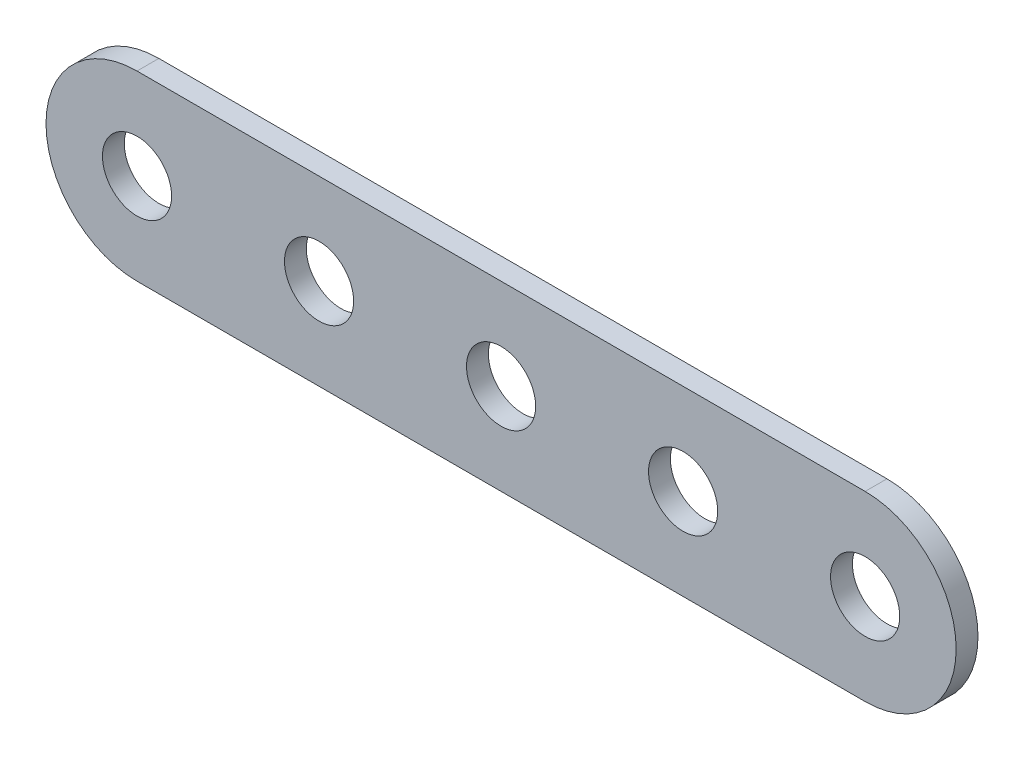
from build123d import *

# Parameters (mm, degrees)
BOSS_EXTRUDE1_DEPTH = 1.524
SKETCH2_R           = 2.413
CUT_EXTRUDE1_DEPTH  = 33.414619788
LPATTERN1_COUNT     = 9
LPATTERN1_PITCH     = 12.7


with BuildPart() as part:
    # Sketch1 → Boss-Extrude1 (new body)
    with BuildSketch(Plane.XY):
        with BuildLine():
            Line((-25.4, -6.35), (25.4, -6.35))
            ThreePointArc((25.4, -6.35), (31.75, 0), (25.4, 6.35))
            Line((25.4, 6.35), (-25.4, 6.35))
            ThreePointArc((-25.4, 6.35), (-31.75, 0), (-25.4, -6.35))
        make_face()
    extrude(amount=BOSS_EXTRUDE1_DEPTH)

    # Sketch2 → Cut-Extrude1 (cut, through all)
    with BuildSketch(Plane.XY.offset(1.524)):
        with Locations((-25.4, 0)):
            Circle(SKETCH2_R)
    cut_extrude1 = extrude(amount=-CUT_EXTRUDE1_DEPTH, mode=Mode.SUBTRACT)

    # LPattern1: Cut-Extrude1 ×9
    with Locations(*[(i * LPATTERN1_PITCH, 0, 0) for i in range(1, LPATTERN1_COUNT)]):
        add(cut_extrude1, mode=Mode.SUBTRACT)


solid = part.part
